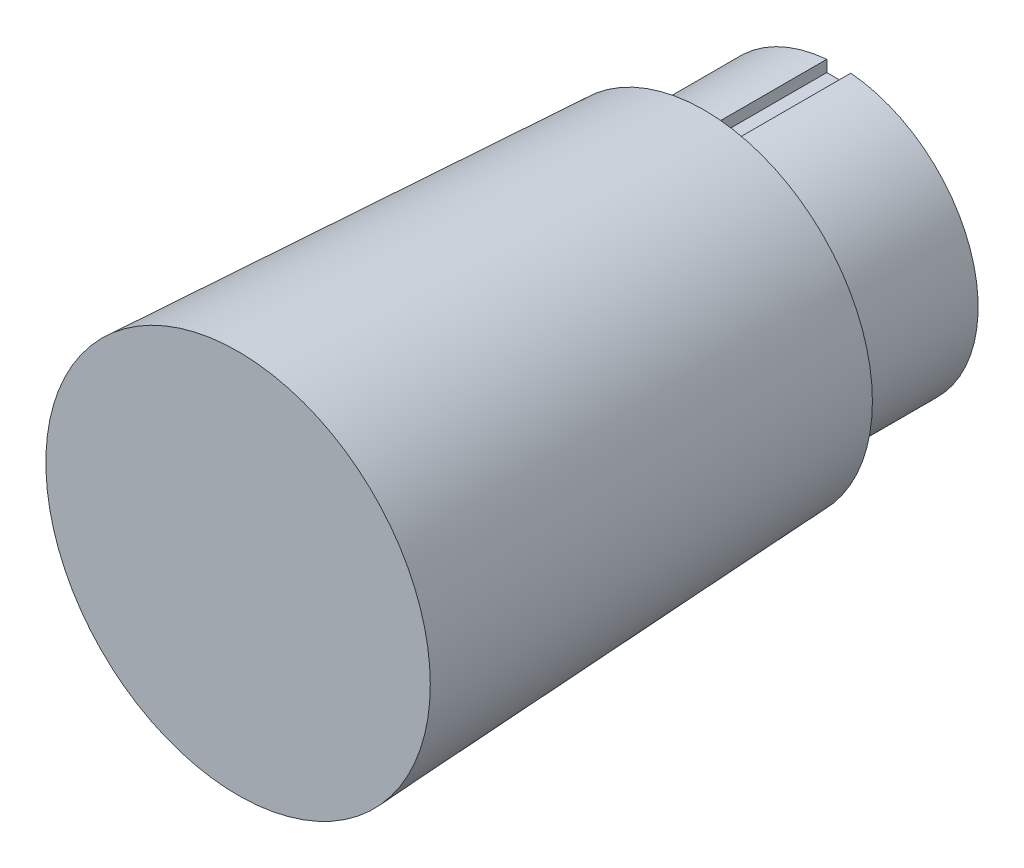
from build123d import *

# Parameters (mm, degrees)
CROQUIS2_W            = 5
CROQUIS2_H            = 5
CORTAR_EXTRUIR1_DEPTH = 28


with BuildPart() as part:
    # Croquis1 → Revoluci_n1 (revolve)
    with BuildSketch(Plane(origin=(0, 0, 0), x_dir=(0, 0, -1), z_dir=(1, 0, 0)), mode=Mode.PRIVATE) as revoluci_n1_sk:
        Polygon((0, 0), (0, 40), (97, 35), (97, 29), (125, 29), (125, 0), align=None)
    revolve(revoluci_n1_sk.sketch.rotate(Axis((0, 0, 0), (0, 0, -1)), 90), axis=Axis((0, 0, 0), (0, 0, -1)))

    # Croquis2 → Cortar-Extruir1 (cut)
    with BuildSketch(Plane(origin=(0, 0, -125), x_dir=(-1, 0, 0), z_dir=(0, 0, -1))):
        with Locations((0, 29)):
            Rectangle(CROQUIS2_W, CROQUIS2_H)
    extrude(amount=-CORTAR_EXTRUIR1_DEPTH, mode=Mode.SUBTRACT)


solid = part.part
